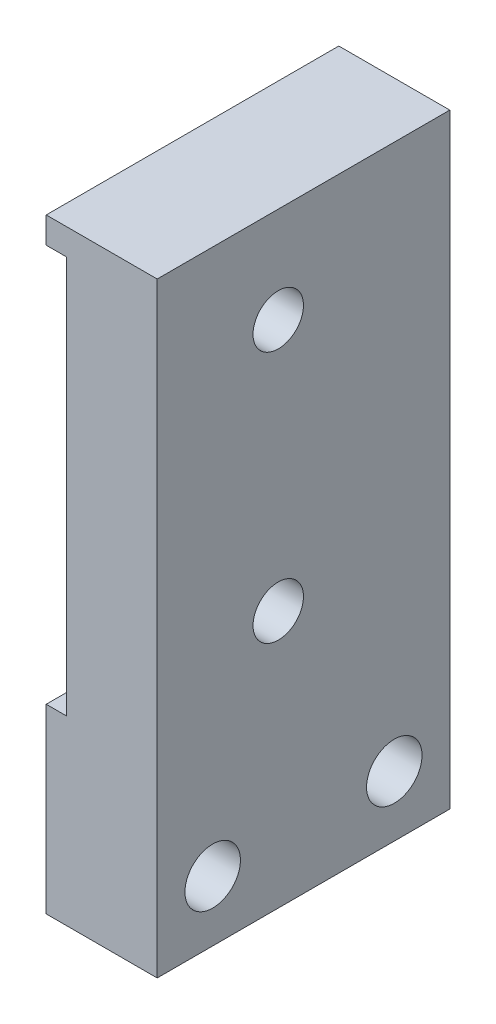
ISO-10303-21;
HEADER;
FILE_DESCRIPTION(('STEP AP214'),'2;1');
FILE_NAME('part.step','',(''),(''),'','','');
FILE_SCHEMA(('AUTOMOTIVE_DESIGN { 1 0 10303 214 1 1 1 1 }'));
ENDSEC;
DATA;
#1=APPLICATION_CONTEXT('core data for automotive mechanical design processes');
#2=APPLICATION_PROTOCOL_DEFINITION('international standard','automotive_design',2000,#1);
#3=PRODUCT_CONTEXT('',#1,'mechanical');
#4=PRODUCT('Part','Part','',(#3));
#5=PRODUCT_RELATED_PRODUCT_CATEGORY('part','',(#4));
#6=PRODUCT_DEFINITION_FORMATION('','',#4);
#7=PRODUCT_DEFINITION_CONTEXT('part definition',#1,'design');
#8=PRODUCT_DEFINITION('design','',#6,#7);
#9=PRODUCT_DEFINITION_SHAPE('','',#8);
#10=(LENGTH_UNIT() NAMED_UNIT(*) SI_UNIT(.MILLI.,.METRE.));
#11=(NAMED_UNIT(*) PLANE_ANGLE_UNIT() SI_UNIT($,.RADIAN.));
#12=(NAMED_UNIT(*) SI_UNIT($,.STERADIAN.) SOLID_ANGLE_UNIT());
#13=UNCERTAINTY_MEASURE_WITH_UNIT(LENGTH_MEASURE(1.E-05),#10,'distance_accuracy_value','');
#14=(GEOMETRIC_REPRESENTATION_CONTEXT(3) GLOBAL_UNCERTAINTY_ASSIGNED_CONTEXT((#13)) GLOBAL_UNIT_ASSIGNED_CONTEXT((#10,
#11,#12)) REPRESENTATION_CONTEXT('',''));
#15=CARTESIAN_POINT('',(0.,0.,0.));
#16=DIRECTION('',(0.,0.,1.));
#17=DIRECTION('',(1.,0.,0.));
#18=AXIS2_PLACEMENT_3D('',#15,#16,#17);
#19=CARTESIAN_POINT('',(2.,0.,29.));
#20=DIRECTION('',(1.,0.,0.));
#21=DIRECTION('',(0.,1.,0.));
#22=AXIS2_PLACEMENT_3D('',#19,#20,#21);
#23=PLANE('',#22);
#24=CARTESIAN_POINT('',(2.,25.5,17.));
#25=DIRECTION('',(-1.,0.,0.));
#26=DIRECTION('',(0.,0.,1.));
#27=AXIS2_PLACEMENT_3D('',#24,#25,#26);
#28=CIRCLE('',#27,2.5);
#29=CARTESIAN_POINT('',(2.,25.5,19.5));
#30=VERTEX_POINT('',#29);
#31=EDGE_CURVE('E152',#30,#30,#28,.T.);
#32=ORIENTED_EDGE('',*,*,#31,.F.);
#33=EDGE_LOOP('',(#32));
#34=FACE_BOUND('',#33,.T.);
#35=CARTESIAN_POINT('',(2.,50.5,17.));
#36=DIRECTION('',(-1.,0.,0.));
#37=DIRECTION('',(0.,0.,1.));
#38=AXIS2_PLACEMENT_3D('',#35,#36,#37);
#39=CIRCLE('',#38,2.5);
#40=CARTESIAN_POINT('',(2.,50.5,19.5));
#41=VERTEX_POINT('',#40);
#42=EDGE_CURVE('E146',#41,#41,#39,.T.);
#43=ORIENTED_EDGE('',*,*,#42,.F.);
#44=EDGE_LOOP('',(#43));
#45=FACE_BOUND('',#44,.T.);
#46=DIRECTION('',(0.,-1.,0.));
#47=VECTOR('',#46,1.);
#48=CARTESIAN_POINT('',(2.,0.,0.));
#49=LINE('',#48,#47);
#50=CARTESIAN_POINT('',(2.,57.4,0.));
#51=VERTEX_POINT('',#50);
#52=CARTESIAN_POINT('',(2.,18.,0.));
#53=VERTEX_POINT('',#52);
#54=EDGE_CURVE('E121',#51,#53,#49,.T.);
#55=ORIENTED_EDGE('',*,*,#54,.T.);
#56=DIRECTION('',(0.,0.,-1.));
#57=VECTOR('',#56,1.);
#58=CARTESIAN_POINT('',(2.,18.,29.));
#59=LINE('',#58,#57);
#60=CARTESIAN_POINT('',(2.,18.,29.));
#61=VERTEX_POINT('',#60);
#62=EDGE_CURVE('E11',#61,#53,#59,.T.);
#63=ORIENTED_EDGE('',*,*,#62,.F.);
#64=DIRECTION('',(0.,-1.,0.));
#65=VECTOR('',#64,1.);
#66=CARTESIAN_POINT('',(2.,0.,29.));
#67=LINE('',#66,#65);
#68=CARTESIAN_POINT('',(2.,57.4,29.));
#69=VERTEX_POINT('',#68);
#70=EDGE_CURVE('E115',#69,#61,#67,.T.);
#71=ORIENTED_EDGE('',*,*,#70,.F.);
#72=DIRECTION('',(0.,0.,-1.));
#73=VECTOR('',#72,1.);
#74=CARTESIAN_POINT('',(2.,57.4,29.));
#75=LINE('',#74,#73);
#76=EDGE_CURVE('E107',#69,#51,#75,.T.);
#77=ORIENTED_EDGE('',*,*,#76,.T.);
#78=EDGE_LOOP('',(#55,#63,#71,#77));
#79=FACE_BOUND('',#78,.T.);
#80=ADVANCED_FACE('F16',(#34,#45,#79),#23,.F.);
#81=CARTESIAN_POINT('',(0.,18.,29.));
#82=DIRECTION('',(0.,-1.,0.));
#83=DIRECTION('',(0.,0.,-1.));
#84=AXIS2_PLACEMENT_3D('',#81,#82,#83);
#85=PLANE('',#84);
#86=DIRECTION('',(-1.,0.,0.));
#87=VECTOR('',#86,1.);
#88=CARTESIAN_POINT('',(0.,18.,0.));
#89=LINE('',#88,#87);
#90=CARTESIAN_POINT('',(0.,18.,0.));
#91=VERTEX_POINT('',#90);
#92=EDGE_CURVE('E168',#53,#91,#89,.T.);
#93=ORIENTED_EDGE('',*,*,#92,.T.);
#94=DIRECTION('',(0.,0.,-1.));
#95=VECTOR('',#94,1.);
#96=CARTESIAN_POINT('',(0.,18.,29.));
#97=LINE('',#96,#95);
#98=CARTESIAN_POINT('',(0.,18.,29.));
#99=VERTEX_POINT('',#98);
#100=EDGE_CURVE('E24',#99,#91,#97,.T.);
#101=ORIENTED_EDGE('',*,*,#100,.F.);
#102=DIRECTION('',(-1.,0.,0.));
#103=VECTOR('',#102,1.);
#104=CARTESIAN_POINT('',(0.,18.,29.));
#105=LINE('',#104,#103);
#106=EDGE_CURVE('E71',#61,#99,#105,.T.);
#107=ORIENTED_EDGE('',*,*,#106,.F.);
#108=ORIENTED_EDGE('',*,*,#62,.T.);
#109=EDGE_LOOP('',(#93,#101,#107,#108));
#110=FACE_BOUND('',#109,.T.);
#111=ADVANCED_FACE('F160',(#110),#85,.F.);
#112=CARTESIAN_POINT('',(0.,0.,29.));
#113=DIRECTION('',(-1.,0.,0.));
#114=DIRECTION('',(0.,0.,1.));
#115=AXIS2_PLACEMENT_3D('',#112,#113,#114);
#116=PLANE('',#115);
#117=CARTESIAN_POINT('',(0.,6.,5.5));
#118=DIRECTION('',(-1.,0.,0.));
#119=DIRECTION('',(0.,0.,1.));
#120=AXIS2_PLACEMENT_3D('',#117,#118,#119);
#121=CIRCLE('',#120,5.);
#122=CARTESIAN_POINT('',(0.,6.,10.5));
#123=VERTEX_POINT('',#122);
#124=EDGE_CURVE('E140',#123,#123,#121,.T.);
#125=ORIENTED_EDGE('',*,*,#124,.F.);
#126=EDGE_LOOP('',(#125));
#127=FACE_BOUND('',#126,.T.);
#128=CARTESIAN_POINT('',(0.,6.,23.5));
#129=DIRECTION('',(-1.,0.,0.));
#130=DIRECTION('',(0.,0.,1.));
#131=AXIS2_PLACEMENT_3D('',#128,#129,#130);
#132=CIRCLE('',#131,5.);
#133=CARTESIAN_POINT('',(0.,6.,28.5));
#134=VERTEX_POINT('',#133);
#135=EDGE_CURVE('E128',#134,#134,#132,.T.);
#136=ORIENTED_EDGE('',*,*,#135,.F.);
#137=EDGE_LOOP('',(#136));
#138=FACE_BOUND('',#137,.T.);
#139=DIRECTION('',(0.,1.,0.));
#140=VECTOR('',#139,1.);
#141=CARTESIAN_POINT('',(0.,0.,0.));
#142=LINE('',#141,#140);
#143=CARTESIAN_POINT('',(0.,0.,0.));
#144=VERTEX_POINT('',#143);
#145=EDGE_CURVE('E171',#144,#91,#142,.T.);
#146=ORIENTED_EDGE('',*,*,#145,.F.);
#147=DIRECTION('',(0.,0.,-1.));
#148=VECTOR('',#147,1.);
#149=CARTESIAN_POINT('',(0.,0.,29.));
#150=LINE('',#149,#148);
#151=CARTESIAN_POINT('',(0.,0.,29.));
#152=VERTEX_POINT('',#151);
#153=EDGE_CURVE('E190',#152,#144,#150,.T.);
#154=ORIENTED_EDGE('',*,*,#153,.F.);
#155=DIRECTION('',(0.,1.,0.));
#156=VECTOR('',#155,1.);
#157=CARTESIAN_POINT('',(0.,0.,29.));
#158=LINE('',#157,#156);
#159=EDGE_CURVE('E106',#152,#99,#158,.T.);
#160=ORIENTED_EDGE('',*,*,#159,.T.);
#161=ORIENTED_EDGE('',*,*,#100,.T.);
#162=EDGE_LOOP('',(#146,#154,#160,#161));
#163=FACE_BOUND('',#162,.T.);
#164=ADVANCED_FACE('F192',(#127,#138,#163),#116,.T.);
#165=CARTESIAN_POINT('',(0.,0.,29.));
#166=DIRECTION('',(0.,1.,0.));
#167=DIRECTION('',(0.,0.,1.));
#168=AXIS2_PLACEMENT_3D('',#165,#166,#167);
#169=PLANE('',#168);
#170=DIRECTION('',(1.,0.,0.));
#171=VECTOR('',#170,1.);
#172=CARTESIAN_POINT('',(0.,0.,0.));
#173=LINE('',#172,#171);
#174=CARTESIAN_POINT('',(11.,0.,0.));
#175=VERTEX_POINT('',#174);
#176=EDGE_CURVE('E176',#144,#175,#173,.T.);
#177=ORIENTED_EDGE('',*,*,#176,.T.);
#178=DIRECTION('',(0.,0.,-1.));
#179=VECTOR('',#178,1.);
#180=CARTESIAN_POINT('',(11.,0.,29.));
#181=LINE('',#180,#179);
#182=CARTESIAN_POINT('',(11.,0.,29.));
#183=VERTEX_POINT('',#182);
#184=EDGE_CURVE('E187',#183,#175,#181,.T.);
#185=ORIENTED_EDGE('',*,*,#184,.F.);
#186=DIRECTION('',(1.,0.,0.));
#187=VECTOR('',#186,1.);
#188=CARTESIAN_POINT('',(0.,0.,29.));
#189=LINE('',#188,#187);
#190=EDGE_CURVE('E112',#152,#183,#189,.T.);
#191=ORIENTED_EDGE('',*,*,#190,.F.);
#192=ORIENTED_EDGE('',*,*,#153,.T.);
#193=EDGE_LOOP('',(#177,#185,#191,#192));
#194=FACE_BOUND('',#193,.T.);
#195=ADVANCED_FACE('F198',(#194),#169,.F.);
#196=CARTESIAN_POINT('',(11.,0.,29.));
#197=DIRECTION('',(-1.,0.,0.));
#198=DIRECTION('',(0.,0.,1.));
#199=AXIS2_PLACEMENT_3D('',#196,#197,#198);
#200=PLANE('',#199);
#201=CARTESIAN_POINT('',(11.,25.5,17.));
#202=DIRECTION('',(-1.,0.,0.));
#203=DIRECTION('',(0.,0.,1.));
#204=AXIS2_PLACEMENT_3D('',#201,#202,#203);
#205=CIRCLE('',#204,2.5);
#206=CARTESIAN_POINT('',(11.,25.5,19.5));
#207=VERTEX_POINT('',#206);
#208=EDGE_CURVE('E149',#207,#207,#205,.T.);
#209=ORIENTED_EDGE('',*,*,#208,.T.);
#210=EDGE_LOOP('',(#209));
#211=FACE_BOUND('',#210,.T.);
#212=CARTESIAN_POINT('',(11.,50.5,17.));
#213=DIRECTION('',(-1.,0.,0.));
#214=DIRECTION('',(0.,0.,1.));
#215=AXIS2_PLACEMENT_3D('',#212,#213,#214);
#216=CIRCLE('',#215,2.5);
#217=CARTESIAN_POINT('',(11.,50.5,19.5));
#218=VERTEX_POINT('',#217);
#219=EDGE_CURVE('E143',#218,#218,#216,.T.);
#220=ORIENTED_EDGE('',*,*,#219,.T.);
#221=EDGE_LOOP('',(#220));
#222=FACE_BOUND('',#221,.T.);
#223=CARTESIAN_POINT('',(11.,6.,5.5));
#224=DIRECTION('',(-1.,0.,0.));
#225=DIRECTION('',(0.,0.,1.));
#226=AXIS2_PLACEMENT_3D('',#223,#224,#225);
#227=CIRCLE('',#226,2.75);
#228=CARTESIAN_POINT('',(11.,6.,8.25));
#229=VERTEX_POINT('',#228);
#230=EDGE_CURVE('E131',#229,#229,#227,.T.);
#231=ORIENTED_EDGE('',*,*,#230,.T.);
#232=EDGE_LOOP('',(#231));
#233=FACE_BOUND('',#232,.T.);
#234=CARTESIAN_POINT('',(11.,6.,23.5));
#235=DIRECTION('',(-1.,0.,0.));
#236=DIRECTION('',(0.,0.,1.));
#237=AXIS2_PLACEMENT_3D('',#234,#235,#236);
#238=CIRCLE('',#237,2.75);
#239=CARTESIAN_POINT('',(11.,6.,26.25));
#240=VERTEX_POINT('',#239);
#241=EDGE_CURVE('E118',#240,#240,#238,.T.);
#242=ORIENTED_EDGE('',*,*,#241,.T.);
#243=EDGE_LOOP('',(#242));
#244=FACE_BOUND('',#243,.T.);
#245=DIRECTION('',(0.,1.,0.));
#246=VECTOR('',#245,1.);
#247=CARTESIAN_POINT('',(11.,0.,0.));
#248=LINE('',#247,#246);
#249=CARTESIAN_POINT('',(11.,60.,0.));
#250=VERTEX_POINT('',#249);
#251=EDGE_CURVE('E179',#175,#250,#248,.T.);
#252=ORIENTED_EDGE('',*,*,#251,.T.);
#253=DIRECTION('',(0.,0.,-1.));
#254=VECTOR('',#253,1.);
#255=CARTESIAN_POINT('',(11.,60.,29.));
#256=LINE('',#255,#254);
#257=CARTESIAN_POINT('',(11.,60.,29.));
#258=VERTEX_POINT('',#257);
#259=EDGE_CURVE('E96',#258,#250,#256,.T.);
#260=ORIENTED_EDGE('',*,*,#259,.F.);
#261=DIRECTION('',(0.,1.,0.));
#262=VECTOR('',#261,1.);
#263=CARTESIAN_POINT('',(11.,0.,29.));
#264=LINE('',#263,#262);
#265=EDGE_CURVE('E101',#183,#258,#264,.T.);
#266=ORIENTED_EDGE('',*,*,#265,.F.);
#267=ORIENTED_EDGE('',*,*,#184,.T.);
#268=EDGE_LOOP('',(#252,#260,#266,#267));
#269=FACE_BOUND('',#268,.T.);
#270=ADVANCED_FACE('F201',(#211,#222,#233,#244,#269),#200,.F.);
#271=CARTESIAN_POINT('',(0.,60.,29.));
#272=DIRECTION('',(0.,1.,0.));
#273=DIRECTION('',(0.,0.,1.));
#274=AXIS2_PLACEMENT_3D('',#271,#272,#273);
#275=PLANE('',#274);
#276=DIRECTION('',(1.,0.,0.));
#277=VECTOR('',#276,1.);
#278=CARTESIAN_POINT('',(0.,60.,0.));
#279=LINE('',#278,#277);
#280=CARTESIAN_POINT('',(0.,60.,0.));
#281=VERTEX_POINT('',#280);
#282=EDGE_CURVE('E91',#281,#250,#279,.T.);
#283=ORIENTED_EDGE('',*,*,#282,.F.);
#284=DIRECTION('',(0.,0.,-1.));
#285=VECTOR('',#284,1.);
#286=CARTESIAN_POINT('',(0.,60.,29.));
#287=LINE('',#286,#285);
#288=CARTESIAN_POINT('',(0.,60.,29.));
#289=VERTEX_POINT('',#288);
#290=EDGE_CURVE('E86',#289,#281,#287,.T.);
#291=ORIENTED_EDGE('',*,*,#290,.F.);
#292=DIRECTION('',(1.,0.,0.));
#293=VECTOR('',#292,1.);
#294=CARTESIAN_POINT('',(0.,60.,29.));
#295=LINE('',#294,#293);
#296=EDGE_CURVE('E89',#289,#258,#295,.T.);
#297=ORIENTED_EDGE('',*,*,#296,.T.);
#298=ORIENTED_EDGE('',*,*,#259,.T.);
#299=EDGE_LOOP('',(#283,#291,#297,#298));
#300=FACE_BOUND('',#299,.T.);
#301=ADVANCED_FACE('F88',(#300),#275,.T.);
#302=CARTESIAN_POINT('',(0.,57.4,0.));
#303=VERTEX_POINT('',#302);
#304=EDGE_CURVE('E177',#303,#281,#142,.T.);
#305=ORIENTED_EDGE('',*,*,#304,.F.);
#306=DIRECTION('',(0.,0.,-1.));
#307=VECTOR('',#306,1.);
#308=CARTESIAN_POINT('',(0.,57.4,29.));
#309=LINE('',#308,#307);
#310=CARTESIAN_POINT('',(0.,57.4,29.));
#311=VERTEX_POINT('',#310);
#312=EDGE_CURVE('E60',#311,#303,#309,.T.);
#313=ORIENTED_EDGE('',*,*,#312,.F.);
#314=EDGE_CURVE('E99',#311,#289,#158,.T.);
#315=ORIENTED_EDGE('',*,*,#314,.T.);
#316=ORIENTED_EDGE('',*,*,#290,.T.);
#317=EDGE_LOOP('',(#305,#313,#315,#316));
#318=FACE_BOUND('',#317,.T.);
#319=ADVANCED_FACE('F104',(#318),#116,.T.);
#320=CARTESIAN_POINT('',(0.,57.4,29.));
#321=DIRECTION('',(0.,1.,0.));
#322=DIRECTION('',(0.,0.,1.));
#323=AXIS2_PLACEMENT_3D('',#320,#321,#322);
#324=PLANE('',#323);
#325=DIRECTION('',(1.,0.,0.));
#326=VECTOR('',#325,1.);
#327=CARTESIAN_POINT('',(0.,57.4,0.));
#328=LINE('',#327,#326);
#329=EDGE_CURVE('E63',#303,#51,#328,.T.);
#330=ORIENTED_EDGE('',*,*,#329,.T.);
#331=ORIENTED_EDGE('',*,*,#76,.F.);
#332=DIRECTION('',(1.,0.,0.));
#333=VECTOR('',#332,1.);
#334=CARTESIAN_POINT('',(0.,57.4,29.));
#335=LINE('',#334,#333);
#336=EDGE_CURVE('E32',#311,#69,#335,.T.);
#337=ORIENTED_EDGE('',*,*,#336,.F.);
#338=ORIENTED_EDGE('',*,*,#312,.T.);
#339=EDGE_LOOP('',(#330,#331,#337,#338));
#340=FACE_BOUND('',#339,.T.);
#341=ADVANCED_FACE('F229',(#340),#324,.F.);
#342=CARTESIAN_POINT('',(0.,0.,29.));
#343=DIRECTION('',(0.,0.,1.));
#344=DIRECTION('',(1.,0.,0.));
#345=AXIS2_PLACEMENT_3D('',#342,#343,#344);
#346=PLANE('',#345);
#347=ORIENTED_EDGE('',*,*,#70,.T.);
#348=ORIENTED_EDGE('',*,*,#106,.T.);
#349=ORIENTED_EDGE('',*,*,#159,.F.);
#350=ORIENTED_EDGE('',*,*,#190,.T.);
#351=ORIENTED_EDGE('',*,*,#265,.T.);
#352=ORIENTED_EDGE('',*,*,#296,.F.);
#353=ORIENTED_EDGE('',*,*,#314,.F.);
#354=ORIENTED_EDGE('',*,*,#336,.T.);
#355=EDGE_LOOP('',(#347,#348,#349,#350,#351,#352,#353,#354));
#356=FACE_BOUND('',#355,.T.);
#357=ADVANCED_FACE('F98',(#356),#346,.T.);
#358=CARTESIAN_POINT('',(0.,0.,0.));
#359=DIRECTION('',(0.,0.,1.));
#360=DIRECTION('',(1.,0.,0.));
#361=AXIS2_PLACEMENT_3D('',#358,#359,#360);
#362=PLANE('',#361);
#363=ORIENTED_EDGE('',*,*,#54,.F.);
#364=ORIENTED_EDGE('',*,*,#329,.F.);
#365=ORIENTED_EDGE('',*,*,#304,.T.);
#366=ORIENTED_EDGE('',*,*,#282,.T.);
#367=ORIENTED_EDGE('',*,*,#251,.F.);
#368=ORIENTED_EDGE('',*,*,#176,.F.);
#369=ORIENTED_EDGE('',*,*,#145,.T.);
#370=ORIENTED_EDGE('',*,*,#92,.F.);
#371=EDGE_LOOP('',(#363,#364,#365,#366,#367,#368,#369,#370));
#372=FACE_BOUND('',#371,.T.);
#373=ADVANCED_FACE('F194',(#372),#362,.F.);
#374=CARTESIAN_POINT('',(0.,6.,23.5));
#375=DIRECTION('',(-1.,0.,0.));
#376=DIRECTION('',(0.,0.,1.));
#377=AXIS2_PLACEMENT_3D('',#374,#375,#376);
#378=CYLINDRICAL_SURFACE('',#377,2.75);
#379=ORIENTED_EDGE('',*,*,#241,.F.);
#380=EDGE_LOOP('',(#379));
#381=FACE_BOUND('',#380,.T.);
#382=CARTESIAN_POINT('',(5.7,6.,23.5));
#383=DIRECTION('',(-1.,0.,0.));
#384=DIRECTION('',(0.,0.,1.));
#385=AXIS2_PLACEMENT_3D('',#382,#383,#384);
#386=CIRCLE('',#385,2.75);
#387=CARTESIAN_POINT('',(5.7,6.,26.25));
#388=VERTEX_POINT('',#387);
#389=EDGE_CURVE('E122',#388,#388,#386,.T.);
#390=ORIENTED_EDGE('',*,*,#389,.T.);
#391=EDGE_LOOP('',(#390));
#392=FACE_BOUND('',#391,.T.);
#393=ADVANCED_FACE('F241',(#381,#392),#378,.F.);
#394=CARTESIAN_POINT('',(5.7,8.75,23.5));
#395=DIRECTION('',(1.,0.,0.));
#396=DIRECTION('',(0.,0.,-1.));
#397=AXIS2_PLACEMENT_3D('',#394,#395,#396);
#398=PLANE('',#397);
#399=ORIENTED_EDGE('',*,*,#389,.F.);
#400=EDGE_LOOP('',(#399));
#401=FACE_BOUND('',#400,.T.);
#402=CARTESIAN_POINT('',(5.7,6.,23.5));
#403=DIRECTION('',(-1.,0.,0.));
#404=DIRECTION('',(0.,0.,1.));
#405=AXIS2_PLACEMENT_3D('',#402,#403,#404);
#406=CIRCLE('',#405,5.);
#407=CARTESIAN_POINT('',(5.7,6.,28.5));
#408=VERTEX_POINT('',#407);
#409=EDGE_CURVE('E125',#408,#408,#406,.T.);
#410=ORIENTED_EDGE('',*,*,#409,.T.);
#411=EDGE_LOOP('',(#410));
#412=FACE_BOUND('',#411,.T.);
#413=ADVANCED_FACE('F245',(#401,#412),#398,.F.);
#414=CARTESIAN_POINT('',(0.,6.,23.5));
#415=DIRECTION('',(-1.,0.,0.));
#416=DIRECTION('',(0.,0.,1.));
#417=AXIS2_PLACEMENT_3D('',#414,#415,#416);
#418=CYLINDRICAL_SURFACE('',#417,5.);
#419=ORIENTED_EDGE('',*,*,#409,.F.);
#420=EDGE_LOOP('',(#419));
#421=FACE_BOUND('',#420,.T.);
#422=ORIENTED_EDGE('',*,*,#135,.T.);
#423=EDGE_LOOP('',(#422));
#424=FACE_BOUND('',#423,.T.);
#425=ADVANCED_FACE('F249',(#421,#424),#418,.F.);
#426=CARTESIAN_POINT('',(0.,6.,5.5));
#427=DIRECTION('',(-1.,0.,0.));
#428=DIRECTION('',(0.,0.,1.));
#429=AXIS2_PLACEMENT_3D('',#426,#427,#428);
#430=CYLINDRICAL_SURFACE('',#429,2.75);
#431=ORIENTED_EDGE('',*,*,#230,.F.);
#432=EDGE_LOOP('',(#431));
#433=FACE_BOUND('',#432,.T.);
#434=CARTESIAN_POINT('',(5.7,6.,5.5));
#435=DIRECTION('',(-1.,0.,0.));
#436=DIRECTION('',(0.,0.,1.));
#437=AXIS2_PLACEMENT_3D('',#434,#435,#436);
#438=CIRCLE('',#437,2.75);
#439=CARTESIAN_POINT('',(5.7,6.,8.25));
#440=VERTEX_POINT('',#439);
#441=EDGE_CURVE('E134',#440,#440,#438,.T.);
#442=ORIENTED_EDGE('',*,*,#441,.T.);
#443=EDGE_LOOP('',(#442));
#444=FACE_BOUND('',#443,.T.);
#445=ADVANCED_FACE('F253',(#433,#444),#430,.F.);
#446=CARTESIAN_POINT('',(5.7,8.75,5.5));
#447=DIRECTION('',(1.,0.,0.));
#448=DIRECTION('',(0.,0.,-1.));
#449=AXIS2_PLACEMENT_3D('',#446,#447,#448);
#450=PLANE('',#449);
#451=ORIENTED_EDGE('',*,*,#441,.F.);
#452=EDGE_LOOP('',(#451));
#453=FACE_BOUND('',#452,.T.);
#454=CARTESIAN_POINT('',(5.7,6.,5.5));
#455=DIRECTION('',(-1.,0.,0.));
#456=DIRECTION('',(0.,0.,1.));
#457=AXIS2_PLACEMENT_3D('',#454,#455,#456);
#458=CIRCLE('',#457,5.);
#459=CARTESIAN_POINT('',(5.7,6.,10.5));
#460=VERTEX_POINT('',#459);
#461=EDGE_CURVE('E137',#460,#460,#458,.T.);
#462=ORIENTED_EDGE('',*,*,#461,.T.);
#463=EDGE_LOOP('',(#462));
#464=FACE_BOUND('',#463,.T.);
#465=ADVANCED_FACE('F257',(#453,#464),#450,.F.);
#466=CARTESIAN_POINT('',(0.,6.,5.5));
#467=DIRECTION('',(-1.,0.,0.));
#468=DIRECTION('',(0.,0.,1.));
#469=AXIS2_PLACEMENT_3D('',#466,#467,#468);
#470=CYLINDRICAL_SURFACE('',#469,5.);
#471=ORIENTED_EDGE('',*,*,#461,.F.);
#472=EDGE_LOOP('',(#471));
#473=FACE_BOUND('',#472,.T.);
#474=ORIENTED_EDGE('',*,*,#124,.T.);
#475=EDGE_LOOP('',(#474));
#476=FACE_BOUND('',#475,.T.);
#477=ADVANCED_FACE('F261',(#473,#476),#470,.F.);
#478=CARTESIAN_POINT('',(2.,50.5,17.));
#479=DIRECTION('',(-1.,0.,0.));
#480=DIRECTION('',(0.,0.,1.));
#481=AXIS2_PLACEMENT_3D('',#478,#479,#480);
#482=CYLINDRICAL_SURFACE('',#481,2.5);
#483=ORIENTED_EDGE('',*,*,#219,.F.);
#484=EDGE_LOOP('',(#483));
#485=FACE_BOUND('',#484,.T.);
#486=ORIENTED_EDGE('',*,*,#42,.T.);
#487=EDGE_LOOP('',(#486));
#488=FACE_BOUND('',#487,.T.);
#489=ADVANCED_FACE('F265',(#485,#488),#482,.F.);
#490=CARTESIAN_POINT('',(2.,25.5,17.));
#491=DIRECTION('',(-1.,0.,0.));
#492=DIRECTION('',(0.,0.,1.));
#493=AXIS2_PLACEMENT_3D('',#490,#491,#492);
#494=CYLINDRICAL_SURFACE('',#493,2.5);
#495=ORIENTED_EDGE('',*,*,#208,.F.);
#496=EDGE_LOOP('',(#495));
#497=FACE_BOUND('',#496,.T.);
#498=ORIENTED_EDGE('',*,*,#31,.T.);
#499=EDGE_LOOP('',(#498));
#500=FACE_BOUND('',#499,.T.);
#501=ADVANCED_FACE('F156',(#497,#500),#494,.F.);
#502=CLOSED_SHELL('',(#80,#111,#164,#195,#270,#301,#319,#341,#357,#373,#393,#413,#425,#445,#465,
#477,#489,#501));
#503=MANIFOLD_SOLID_BREP('B1',#502);
#504=ADVANCED_BREP_SHAPE_REPRESENTATION('',(#18,#503),#14);
#505=SHAPE_DEFINITION_REPRESENTATION(#9,#504);
ENDSEC;
END-ISO-10303-21;
